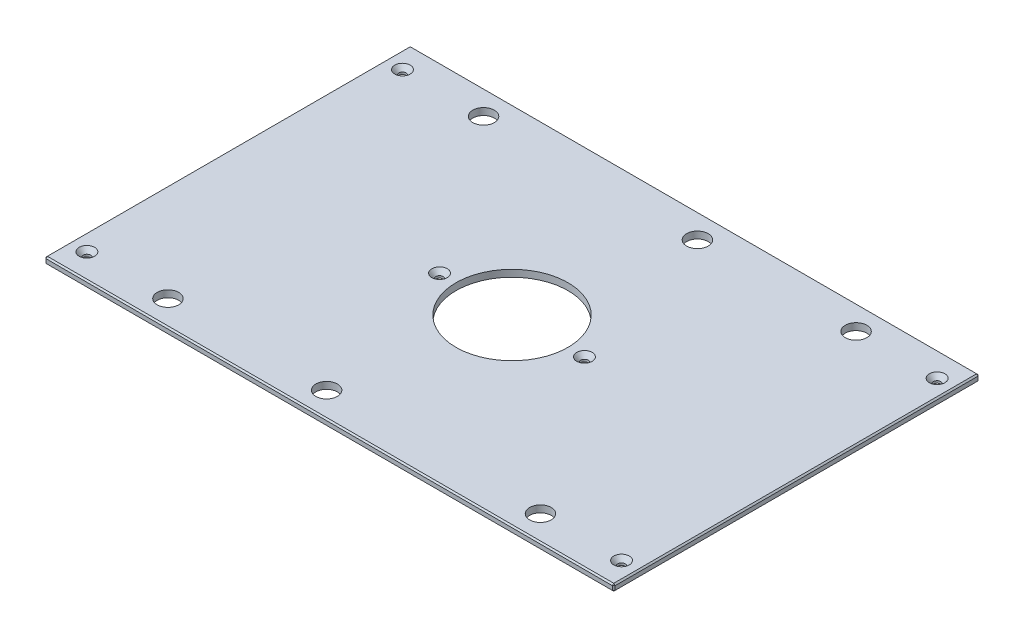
ISO-10303-21;
HEADER;
FILE_DESCRIPTION(('STEP AP214'),'2;1');
FILE_NAME('part.step','',(''),(''),'','','');
FILE_SCHEMA(('AUTOMOTIVE_DESIGN { 1 0 10303 214 1 1 1 1 }'));
ENDSEC;
DATA;
#1=APPLICATION_CONTEXT('core data for automotive mechanical design processes');
#2=APPLICATION_PROTOCOL_DEFINITION('international standard','automotive_design',2000,#1);
#3=PRODUCT_CONTEXT('',#1,'mechanical');
#4=PRODUCT('Part','Part','',(#3));
#5=PRODUCT_RELATED_PRODUCT_CATEGORY('part','',(#4));
#6=PRODUCT_DEFINITION_FORMATION('','',#4);
#7=PRODUCT_DEFINITION_CONTEXT('part definition',#1,'design');
#8=PRODUCT_DEFINITION('design','',#6,#7);
#9=PRODUCT_DEFINITION_SHAPE('','',#8);
#10=(LENGTH_UNIT() NAMED_UNIT(*) SI_UNIT(.MILLI.,.METRE.));
#11=(NAMED_UNIT(*) PLANE_ANGLE_UNIT() SI_UNIT($,.RADIAN.));
#12=(NAMED_UNIT(*) SI_UNIT($,.STERADIAN.) SOLID_ANGLE_UNIT());
#13=UNCERTAINTY_MEASURE_WITH_UNIT(LENGTH_MEASURE(1.E-05),#10,'distance_accuracy_value','');
#14=(GEOMETRIC_REPRESENTATION_CONTEXT(3) GLOBAL_UNCERTAINTY_ASSIGNED_CONTEXT((#13)) GLOBAL_UNIT_ASSIGNED_CONTEXT((#10,
#11,#12)) REPRESENTATION_CONTEXT('',''));
#15=CARTESIAN_POINT('',(0.,0.,0.));
#16=DIRECTION('',(0.,0.,1.));
#17=DIRECTION('',(1.,0.,0.));
#18=AXIS2_PLACEMENT_3D('',#15,#16,#17);
#19=CARTESIAN_POINT('',(-261.9375,6.35,-168.275));
#20=DIRECTION('',(1.,0.,0.));
#21=DIRECTION('',(0.,0.,-1.));
#22=AXIS2_PLACEMENT_3D('',#19,#20,#21);
#23=PLANE('',#22);
#24=DIRECTION('',(0.,0.,-1.));
#25=VECTOR('',#24,1.);
#26=CARTESIAN_POINT('',(-261.9375,5.08000000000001,-168.275));
#27=LINE('',#26,#25);
#28=CARTESIAN_POINT('',(-261.9375,5.08000000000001,167.005));
#29=VERTEX_POINT('',#28);
#30=CARTESIAN_POINT('',(-261.9375,5.08000000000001,-167.005));
#31=VERTEX_POINT('',#30);
#32=EDGE_CURVE('E135',#29,#31,#27,.T.);
#33=ORIENTED_EDGE('',*,*,#32,.T.);
#34=DIRECTION('',(0.,-1.,0.));
#35=VECTOR('',#34,1.);
#36=CARTESIAN_POINT('',(-261.9375,6.35,-167.005));
#37=LINE('',#36,#35);
#38=CARTESIAN_POINT('',(-261.9375,1.26999999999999,-167.005));
#39=VERTEX_POINT('',#38);
#40=EDGE_CURVE('E131',#31,#39,#37,.T.);
#41=ORIENTED_EDGE('',*,*,#40,.T.);
#42=DIRECTION('',(0.,0.,1.));
#43=VECTOR('',#42,1.);
#44=CARTESIAN_POINT('',(-261.9375,1.26999999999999,-168.275));
#45=LINE('',#44,#43);
#46=CARTESIAN_POINT('',(-261.9375,1.26999999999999,167.005));
#47=VERTEX_POINT('',#46);
#48=EDGE_CURVE('E126',#39,#47,#45,.T.);
#49=ORIENTED_EDGE('',*,*,#48,.T.);
#50=DIRECTION('',(0.,1.,0.));
#51=VECTOR('',#50,1.);
#52=CARTESIAN_POINT('',(-261.9375,6.35,167.005));
#53=LINE('',#52,#51);
#54=EDGE_CURVE('E128',#47,#29,#53,.T.);
#55=ORIENTED_EDGE('',*,*,#54,.T.);
#56=EDGE_LOOP('',(#33,#41,#49,#55));
#57=FACE_BOUND('',#56,.T.);
#58=ADVANCED_FACE('F35',(#57),#23,.F.);
#59=CARTESIAN_POINT('',(-261.9375,6.35,168.275));
#60=DIRECTION('',(0.,0.,-1.));
#61=DIRECTION('',(-1.,0.,0.));
#62=AXIS2_PLACEMENT_3D('',#59,#60,#61);
#63=PLANE('',#62);
#64=DIRECTION('',(1.,0.,0.));
#65=VECTOR('',#64,1.);
#66=CARTESIAN_POINT('',(-261.9375,1.26999999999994,168.275));
#67=LINE('',#66,#65);
#68=CARTESIAN_POINT('',(-260.6675,1.26999999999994,168.275));
#69=VERTEX_POINT('',#68);
#70=CARTESIAN_POINT('',(260.6675,1.26999999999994,168.275));
#71=VERTEX_POINT('',#70);
#72=EDGE_CURVE('E58',#69,#71,#67,.T.);
#73=ORIENTED_EDGE('',*,*,#72,.T.);
#74=DIRECTION('',(0.,1.,0.));
#75=VECTOR('',#74,1.);
#76=CARTESIAN_POINT('',(260.6675,6.35,168.275));
#77=LINE('',#76,#75);
#78=CARTESIAN_POINT('',(260.6675,5.08000000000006,168.275));
#79=VERTEX_POINT('',#78);
#80=EDGE_CURVE('E11',#71,#79,#77,.T.);
#81=ORIENTED_EDGE('',*,*,#80,.T.);
#82=DIRECTION('',(-1.,0.,0.));
#83=VECTOR('',#82,1.);
#84=CARTESIAN_POINT('',(-261.9375,5.08000000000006,168.275));
#85=LINE('',#84,#83);
#86=CARTESIAN_POINT('',(-260.6675,5.08000000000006,168.275));
#87=VERTEX_POINT('',#86);
#88=EDGE_CURVE('E44',#79,#87,#85,.T.);
#89=ORIENTED_EDGE('',*,*,#88,.T.);
#90=DIRECTION('',(0.,-1.,0.));
#91=VECTOR('',#90,1.);
#92=CARTESIAN_POINT('',(-260.6675,6.35,168.275));
#93=LINE('',#92,#91);
#94=EDGE_CURVE('E291',#87,#69,#93,.T.);
#95=ORIENTED_EDGE('',*,*,#94,.T.);
#96=EDGE_LOOP('',(#73,#81,#89,#95));
#97=FACE_BOUND('',#96,.T.);
#98=ADVANCED_FACE('F360',(#97),#63,.F.);
#99=CARTESIAN_POINT('',(261.9375,6.35,-168.275));
#100=DIRECTION('',(-1.,0.,0.));
#101=DIRECTION('',(0.,0.,1.));
#102=AXIS2_PLACEMENT_3D('',#99,#100,#101);
#103=PLANE('',#102);
#104=DIRECTION('',(0.,0.,-1.));
#105=VECTOR('',#104,1.);
#106=CARTESIAN_POINT('',(261.9375,1.26999999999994,-168.275));
#107=LINE('',#106,#105);
#108=CARTESIAN_POINT('',(261.9375,1.26999999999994,167.005));
#109=VERTEX_POINT('',#108);
#110=CARTESIAN_POINT('',(261.9375,1.26999999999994,-167.005));
#111=VERTEX_POINT('',#110);
#112=EDGE_CURVE('E286',#109,#111,#107,.T.);
#113=ORIENTED_EDGE('',*,*,#112,.T.);
#114=DIRECTION('',(0.,1.,0.));
#115=VECTOR('',#114,1.);
#116=CARTESIAN_POINT('',(261.9375,6.35,-167.005));
#117=LINE('',#116,#115);
#118=CARTESIAN_POINT('',(261.9375,5.08000000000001,-167.005));
#119=VERTEX_POINT('',#118);
#120=EDGE_CURVE('E288',#111,#119,#117,.T.);
#121=ORIENTED_EDGE('',*,*,#120,.T.);
#122=DIRECTION('',(0.,0.,1.));
#123=VECTOR('',#122,1.);
#124=CARTESIAN_POINT('',(261.9375,5.08000000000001,168.275));
#125=LINE('',#124,#123);
#126=CARTESIAN_POINT('',(261.9375,5.08000000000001,167.005));
#127=VERTEX_POINT('',#126);
#128=EDGE_CURVE('E284',#119,#127,#125,.T.);
#129=ORIENTED_EDGE('',*,*,#128,.T.);
#130=DIRECTION('',(0.,-1.,0.));
#131=VECTOR('',#130,1.);
#132=CARTESIAN_POINT('',(261.9375,6.35,167.005));
#133=LINE('',#132,#131);
#134=EDGE_CURVE('E282',#127,#109,#133,.T.);
#135=ORIENTED_EDGE('',*,*,#134,.T.);
#136=EDGE_LOOP('',(#113,#121,#129,#135));
#137=FACE_BOUND('',#136,.T.);
#138=ADVANCED_FACE('F347',(#137),#103,.F.);
#139=CARTESIAN_POINT('',(-261.9375,6.35,-168.275));
#140=DIRECTION('',(0.,0.,1.));
#141=DIRECTION('',(1.,0.,0.));
#142=AXIS2_PLACEMENT_3D('',#139,#140,#141);
#143=PLANE('',#142);
#144=DIRECTION('',(-1.,0.,0.));
#145=VECTOR('',#144,1.);
#146=CARTESIAN_POINT('',(-261.9375,1.26999999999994,-168.275));
#147=LINE('',#146,#145);
#148=CARTESIAN_POINT('',(260.6675,1.26999999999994,-168.275));
#149=VERTEX_POINT('',#148);
#150=CARTESIAN_POINT('',(-260.6675,1.26999999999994,-168.275));
#151=VERTEX_POINT('',#150);
#152=EDGE_CURVE('E258',#149,#151,#147,.T.);
#153=ORIENTED_EDGE('',*,*,#152,.T.);
#154=DIRECTION('',(0.,1.,0.));
#155=VECTOR('',#154,1.);
#156=CARTESIAN_POINT('',(-260.6675,6.35,-168.275));
#157=LINE('',#156,#155);
#158=CARTESIAN_POINT('',(-260.6675,5.08000000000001,-168.275));
#159=VERTEX_POINT('',#158);
#160=EDGE_CURVE('E262',#151,#159,#157,.T.);
#161=ORIENTED_EDGE('',*,*,#160,.T.);
#162=DIRECTION('',(1.,0.,0.));
#163=VECTOR('',#162,1.);
#164=CARTESIAN_POINT('',(261.9375,5.08000000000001,-168.275));
#165=LINE('',#164,#163);
#166=CARTESIAN_POINT('',(260.6675,5.08000000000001,-168.275));
#167=VERTEX_POINT('',#166);
#168=EDGE_CURVE('E260',#159,#167,#165,.T.);
#169=ORIENTED_EDGE('',*,*,#168,.T.);
#170=DIRECTION('',(0.,-1.,0.));
#171=VECTOR('',#170,1.);
#172=CARTESIAN_POINT('',(260.6675,6.35,-168.275));
#173=LINE('',#172,#171);
#174=EDGE_CURVE('E256',#167,#149,#173,.T.);
#175=ORIENTED_EDGE('',*,*,#174,.T.);
#176=EDGE_LOOP('',(#153,#161,#169,#175));
#177=FACE_BOUND('',#176,.T.);
#178=ADVANCED_FACE('F321',(#177),#143,.F.);
#179=CARTESIAN_POINT('',(0.,6.35,0.));
#180=DIRECTION('',(0.,1.,0.));
#181=DIRECTION('',(0.,0.,1.));
#182=AXIS2_PLACEMENT_3D('',#179,#180,#181);
#183=PLANE('',#182);
#184=CARTESIAN_POINT('',(246.0625,6.35,-145.25498));
#185=DIRECTION('',(0.,1.,0.));
#186=DIRECTION('',(0.,0.,1.));
#187=AXIS2_PLACEMENT_3D('',#184,#185,#186);
#188=CIRCLE('',#187,7.13739999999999);
#189=CARTESIAN_POINT('',(246.0625,6.35,-138.11758));
#190=VERTEX_POINT('',#189);
#191=EDGE_CURVE('E784',#190,#190,#188,.T.);
#192=ORIENTED_EDGE('',*,*,#191,.F.);
#193=EDGE_LOOP('',(#192));
#194=FACE_BOUND('',#193,.T.);
#195=CARTESIAN_POINT('',(246.0625,6.35,145.25498));
#196=DIRECTION('',(0.,1.,0.));
#197=DIRECTION('',(0.,0.,1.));
#198=AXIS2_PLACEMENT_3D('',#195,#196,#197);
#199=CIRCLE('',#198,7.13739999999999);
#200=CARTESIAN_POINT('',(246.0625,6.35,152.39238));
#201=VERTEX_POINT('',#200);
#202=EDGE_CURVE('E788',#201,#201,#199,.T.);
#203=ORIENTED_EDGE('',*,*,#202,.F.);
#204=EDGE_LOOP('',(#203));
#205=FACE_BOUND('',#204,.T.);
#206=CARTESIAN_POINT('',(-246.0625,6.35,145.25498));
#207=DIRECTION('',(0.,1.,0.));
#208=DIRECTION('',(0.,0.,1.));
#209=AXIS2_PLACEMENT_3D('',#206,#207,#208);
#210=CIRCLE('',#209,7.13739999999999);
#211=CARTESIAN_POINT('',(-246.0625,6.35,152.39238));
#212=VERTEX_POINT('',#211);
#213=EDGE_CURVE('E792',#212,#212,#210,.T.);
#214=ORIENTED_EDGE('',*,*,#213,.F.);
#215=EDGE_LOOP('',(#214));
#216=FACE_BOUND('',#215,.T.);
#217=CARTESIAN_POINT('',(-66.675,6.35,0.));
#218=DIRECTION('',(0.,1.,0.));
#219=DIRECTION('',(0.,0.,1.));
#220=AXIS2_PLACEMENT_3D('',#217,#218,#219);
#221=CIRCLE('',#220,7.1374);
#222=CARTESIAN_POINT('',(-66.675,6.35,7.1374));
#223=VERTEX_POINT('',#222);
#224=EDGE_CURVE('E796',#223,#223,#221,.T.);
#225=ORIENTED_EDGE('',*,*,#224,.F.);
#226=EDGE_LOOP('',(#225));
#227=FACE_BOUND('',#226,.T.);
#228=CARTESIAN_POINT('',(66.675,6.35,0.));
#229=DIRECTION('',(0.,1.,0.));
#230=DIRECTION('',(0.,0.,1.));
#231=AXIS2_PLACEMENT_3D('',#228,#229,#230);
#232=CIRCLE('',#231,7.1374);
#233=CARTESIAN_POINT('',(66.675,6.35,7.1374));
#234=VERTEX_POINT('',#233);
#235=EDGE_CURVE('E800',#234,#234,#232,.T.);
#236=ORIENTED_EDGE('',*,*,#235,.F.);
#237=EDGE_LOOP('',(#236));
#238=FACE_BOUND('',#237,.T.);
#239=CARTESIAN_POINT('',(-246.0625,6.35,-145.25498));
#240=DIRECTION('',(0.,1.,0.));
#241=DIRECTION('',(0.,0.,1.));
#242=AXIS2_PLACEMENT_3D('',#239,#240,#241);
#243=CIRCLE('',#242,7.13739999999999);
#244=CARTESIAN_POINT('',(-246.0625,6.35,-138.11758));
#245=VERTEX_POINT('',#244);
#246=EDGE_CURVE('E803',#245,#245,#243,.T.);
#247=ORIENTED_EDGE('',*,*,#246,.F.);
#248=EDGE_LOOP('',(#247));
#249=FACE_BOUND('',#248,.T.);
#250=DIRECTION('',(0.,0.,-1.));
#251=VECTOR('',#250,1.);
#252=CARTESIAN_POINT('',(260.6675,6.35,-168.275));
#253=LINE('',#252,#251);
#254=CARTESIAN_POINT('',(260.6675,6.35,167.005));
#255=VERTEX_POINT('',#254);
#256=CARTESIAN_POINT('',(260.6675,6.35,-167.005));
#257=VERTEX_POINT('',#256);
#258=EDGE_CURVE('E269',#255,#257,#253,.T.);
#259=ORIENTED_EDGE('',*,*,#258,.T.);
#260=DIRECTION('',(-1.,0.,0.));
#261=VECTOR('',#260,1.);
#262=CARTESIAN_POINT('',(-261.9375,6.35,-167.005));
#263=LINE('',#262,#261);
#264=CARTESIAN_POINT('',(-260.6675,6.35,-167.005));
#265=VERTEX_POINT('',#264);
#266=EDGE_CURVE('E271',#257,#265,#263,.T.);
#267=ORIENTED_EDGE('',*,*,#266,.T.);
#268=DIRECTION('',(0.,0.,1.));
#269=VECTOR('',#268,1.);
#270=CARTESIAN_POINT('',(-260.6675,6.35,168.275));
#271=LINE('',#270,#269);
#272=CARTESIAN_POINT('',(-260.6675,6.35,167.005));
#273=VERTEX_POINT('',#272);
#274=EDGE_CURVE('E267',#265,#273,#271,.T.);
#275=ORIENTED_EDGE('',*,*,#274,.T.);
#276=DIRECTION('',(1.,0.,0.));
#277=VECTOR('',#276,1.);
#278=CARTESIAN_POINT('',(261.9375,6.35,167.005));
#279=LINE('',#278,#277);
#280=EDGE_CURVE('E265',#273,#255,#279,.T.);
#281=ORIENTED_EDGE('',*,*,#280,.T.);
#282=EDGE_LOOP('',(#259,#267,#275,#281));
#283=FACE_BOUND('',#282,.T.);
#284=CARTESIAN_POINT('',(171.45,6.35,-145.25498));
#285=DIRECTION('',(0.,1.,0.));
#286=DIRECTION('',(0.,0.,1.));
#287=AXIS2_PLACEMENT_3D('',#284,#285,#286);
#288=CIRCLE('',#287,9.921875);
#289=CARTESIAN_POINT('',(171.45,6.35,-135.333105));
#290=VERTEX_POINT('',#289);
#291=EDGE_CURVE('E204',#290,#290,#288,.T.);
#292=ORIENTED_EDGE('',*,*,#291,.F.);
#293=EDGE_LOOP('',(#292));
#294=FACE_BOUND('',#293,.T.);
#295=CARTESIAN_POINT('',(-171.45,6.35,-145.25498));
#296=DIRECTION('',(0.,1.,0.));
#297=DIRECTION('',(0.,0.,1.));
#298=AXIS2_PLACEMENT_3D('',#295,#296,#297);
#299=CIRCLE('',#298,9.921875);
#300=CARTESIAN_POINT('',(-171.45,6.35,-135.333105));
#301=VERTEX_POINT('',#300);
#302=EDGE_CURVE('E214',#301,#301,#299,.T.);
#303=ORIENTED_EDGE('',*,*,#302,.F.);
#304=EDGE_LOOP('',(#303));
#305=FACE_BOUND('',#304,.T.);
#306=CARTESIAN_POINT('',(171.45,6.35,145.25498));
#307=DIRECTION('',(0.,1.,0.));
#308=DIRECTION('',(0.,0.,1.));
#309=AXIS2_PLACEMENT_3D('',#306,#307,#308);
#310=CIRCLE('',#309,9.921875);
#311=CARTESIAN_POINT('',(171.45,6.35,155.176855));
#312=VERTEX_POINT('',#311);
#313=EDGE_CURVE('E225',#312,#312,#310,.T.);
#314=ORIENTED_EDGE('',*,*,#313,.F.);
#315=EDGE_LOOP('',(#314));
#316=FACE_BOUND('',#315,.T.);
#317=CARTESIAN_POINT('',(-171.45,6.35,145.25498));
#318=DIRECTION('',(0.,1.,0.));
#319=DIRECTION('',(0.,0.,1.));
#320=AXIS2_PLACEMENT_3D('',#317,#318,#319);
#321=CIRCLE('',#320,9.921875);
#322=CARTESIAN_POINT('',(-171.45,6.35,155.176855));
#323=VERTEX_POINT('',#322);
#324=EDGE_CURVE('E231',#323,#323,#321,.T.);
#325=ORIENTED_EDGE('',*,*,#324,.F.);
#326=EDGE_LOOP('',(#325));
#327=FACE_BOUND('',#326,.T.);
#328=CARTESIAN_POINT('',(25.4,6.35,-145.25498));
#329=DIRECTION('',(0.,1.,0.));
#330=DIRECTION('',(0.,0.,1.));
#331=AXIS2_PLACEMENT_3D('',#328,#329,#330);
#332=CIRCLE('',#331,9.921875);
#333=CARTESIAN_POINT('',(25.4,6.35,-135.333105));
#334=VERTEX_POINT('',#333);
#335=EDGE_CURVE('E237',#334,#334,#332,.T.);
#336=ORIENTED_EDGE('',*,*,#335,.F.);
#337=EDGE_LOOP('',(#336));
#338=FACE_BOUND('',#337,.T.);
#339=CARTESIAN_POINT('',(-25.4,6.35,145.25498));
#340=DIRECTION('',(0.,1.,0.));
#341=DIRECTION('',(0.,0.,1.));
#342=AXIS2_PLACEMENT_3D('',#339,#340,#341);
#343=CIRCLE('',#342,9.921875);
#344=CARTESIAN_POINT('',(-25.4,6.35,155.176855));
#345=VERTEX_POINT('',#344);
#346=EDGE_CURVE('E243',#345,#345,#343,.T.);
#347=ORIENTED_EDGE('',*,*,#346,.F.);
#348=EDGE_LOOP('',(#347));
#349=FACE_BOUND('',#348,.T.);
#350=CARTESIAN_POINT('',(0.,6.35,0.));
#351=DIRECTION('',(0.,1.,0.));
#352=DIRECTION('',(0.,0.,1.));
#353=AXIS2_PLACEMENT_3D('',#350,#351,#352);
#354=CIRCLE('',#353,51.562);
#355=CARTESIAN_POINT('',(0.,6.35,51.562));
#356=VERTEX_POINT('',#355);
#357=EDGE_CURVE('E249',#356,#356,#354,.T.);
#358=ORIENTED_EDGE('',*,*,#357,.F.);
#359=EDGE_LOOP('',(#358));
#360=FACE_BOUND('',#359,.T.);
#361=ADVANCED_FACE('F369',(#194,#205,#216,#227,#238,#249,#283,#294,#305,#316,#327,#338,#349,
#360),#183,.T.);
#362=CARTESIAN_POINT('',(0.,0.,0.));
#363=DIRECTION('',(0.,1.,0.));
#364=DIRECTION('',(0.,0.,1.));
#365=AXIS2_PLACEMENT_3D('',#362,#363,#364);
#366=PLANE('',#365);
#367=CARTESIAN_POINT('',(246.0625,0.,-145.25498));
#368=DIRECTION('',(0.,1.,0.));
#369=DIRECTION('',(0.,0.,1.));
#370=AXIS2_PLACEMENT_3D('',#367,#368,#369);
#371=CIRCLE('',#370,3.3782);
#372=CARTESIAN_POINT('',(246.0625,0.,-141.87678));
#373=VERTEX_POINT('',#372);
#374=EDGE_CURVE('E837',#373,#373,#371,.T.);
#375=ORIENTED_EDGE('',*,*,#374,.T.);
#376=EDGE_LOOP('',(#375));
#377=FACE_BOUND('',#376,.T.);
#378=CARTESIAN_POINT('',(246.0625,0.,145.25498));
#379=DIRECTION('',(0.,1.,0.));
#380=DIRECTION('',(0.,0.,1.));
#381=AXIS2_PLACEMENT_3D('',#378,#379,#380);
#382=CIRCLE('',#381,3.3782);
#383=CARTESIAN_POINT('',(246.0625,0.,148.63318));
#384=VERTEX_POINT('',#383);
#385=EDGE_CURVE('E830',#384,#384,#382,.T.);
#386=ORIENTED_EDGE('',*,*,#385,.T.);
#387=EDGE_LOOP('',(#386));
#388=FACE_BOUND('',#387,.T.);
#389=CARTESIAN_POINT('',(-246.0625,0.,145.25498));
#390=DIRECTION('',(0.,1.,0.));
#391=DIRECTION('',(0.,0.,1.));
#392=AXIS2_PLACEMENT_3D('',#389,#390,#391);
#393=CIRCLE('',#392,3.3782);
#394=CARTESIAN_POINT('',(-246.0625,0.,148.63318));
#395=VERTEX_POINT('',#394);
#396=EDGE_CURVE('E823',#395,#395,#393,.T.);
#397=ORIENTED_EDGE('',*,*,#396,.T.);
#398=EDGE_LOOP('',(#397));
#399=FACE_BOUND('',#398,.T.);
#400=CARTESIAN_POINT('',(-66.675,0.,0.));
#401=DIRECTION('',(0.,1.,0.));
#402=DIRECTION('',(0.,0.,1.));
#403=AXIS2_PLACEMENT_3D('',#400,#401,#402);
#404=CIRCLE('',#403,3.3782);
#405=CARTESIAN_POINT('',(-66.675,0.,3.3782));
#406=VERTEX_POINT('',#405);
#407=EDGE_CURVE('E816',#406,#406,#404,.T.);
#408=ORIENTED_EDGE('',*,*,#407,.T.);
#409=EDGE_LOOP('',(#408));
#410=FACE_BOUND('',#409,.T.);
#411=CARTESIAN_POINT('',(66.675,0.,0.));
#412=DIRECTION('',(0.,1.,0.));
#413=DIRECTION('',(0.,0.,1.));
#414=AXIS2_PLACEMENT_3D('',#411,#412,#413);
#415=CIRCLE('',#414,3.3782);
#416=CARTESIAN_POINT('',(66.675,0.,3.3782));
#417=VERTEX_POINT('',#416);
#418=EDGE_CURVE('E806',#417,#417,#415,.T.);
#419=ORIENTED_EDGE('',*,*,#418,.T.);
#420=EDGE_LOOP('',(#419));
#421=FACE_BOUND('',#420,.T.);
#422=CARTESIAN_POINT('',(-246.0625,0.,-145.25498));
#423=DIRECTION('',(0.,1.,0.));
#424=DIRECTION('',(0.,0.,1.));
#425=AXIS2_PLACEMENT_3D('',#422,#423,#424);
#426=CIRCLE('',#425,3.3782);
#427=CARTESIAN_POINT('',(-246.0625,0.,-141.87678));
#428=VERTEX_POINT('',#427);
#429=EDGE_CURVE('E217',#428,#428,#426,.T.);
#430=ORIENTED_EDGE('',*,*,#429,.T.);
#431=EDGE_LOOP('',(#430));
#432=FACE_BOUND('',#431,.T.);
#433=DIRECTION('',(0.,0.,-1.));
#434=VECTOR('',#433,1.);
#435=CARTESIAN_POINT('',(-260.6675,0.,0.));
#436=LINE('',#435,#434);
#437=CARTESIAN_POINT('',(-260.6675,0.,167.005));
#438=VERTEX_POINT('',#437);
#439=CARTESIAN_POINT('',(-260.6675,0.,-167.005));
#440=VERTEX_POINT('',#439);
#441=EDGE_CURVE('E158',#438,#440,#436,.T.);
#442=ORIENTED_EDGE('',*,*,#441,.T.);
#443=DIRECTION('',(1.,0.,0.));
#444=VECTOR('',#443,1.);
#445=CARTESIAN_POINT('',(0.,0.,-167.005));
#446=LINE('',#445,#444);
#447=CARTESIAN_POINT('',(260.6675,0.,-167.005));
#448=VERTEX_POINT('',#447);
#449=EDGE_CURVE('E279',#440,#448,#446,.T.);
#450=ORIENTED_EDGE('',*,*,#449,.T.);
#451=DIRECTION('',(0.,0.,1.));
#452=VECTOR('',#451,1.);
#453=CARTESIAN_POINT('',(260.6675,0.,0.));
#454=LINE('',#453,#452);
#455=CARTESIAN_POINT('',(260.6675,0.,167.005));
#456=VERTEX_POINT('',#455);
#457=EDGE_CURVE('E277',#448,#456,#454,.T.);
#458=ORIENTED_EDGE('',*,*,#457,.T.);
#459=DIRECTION('',(-1.,0.,0.));
#460=VECTOR('',#459,1.);
#461=CARTESIAN_POINT('',(0.,0.,167.005));
#462=LINE('',#461,#460);
#463=EDGE_CURVE('E274',#456,#438,#462,.T.);
#464=ORIENTED_EDGE('',*,*,#463,.T.);
#465=EDGE_LOOP('',(#442,#450,#458,#464));
#466=FACE_BOUND('',#465,.T.);
#467=CARTESIAN_POINT('',(171.45,0.,-145.25498));
#468=DIRECTION('',(0.,1.,0.));
#469=DIRECTION('',(0.,0.,1.));
#470=AXIS2_PLACEMENT_3D('',#467,#468,#469);
#471=CIRCLE('',#470,9.921875);
#472=CARTESIAN_POINT('',(171.45,0.,-135.333105));
#473=VERTEX_POINT('',#472);
#474=EDGE_CURVE('E209',#473,#473,#471,.T.);
#475=ORIENTED_EDGE('',*,*,#474,.T.);
#476=EDGE_LOOP('',(#475));
#477=FACE_BOUND('',#476,.T.);
#478=CARTESIAN_POINT('',(-171.45,0.,-145.25498));
#479=DIRECTION('',(0.,1.,0.));
#480=DIRECTION('',(0.,0.,1.));
#481=AXIS2_PLACEMENT_3D('',#478,#479,#480);
#482=CIRCLE('',#481,9.921875);
#483=CARTESIAN_POINT('',(-171.45,0.,-135.333105));
#484=VERTEX_POINT('',#483);
#485=EDGE_CURVE('E222',#484,#484,#482,.T.);
#486=ORIENTED_EDGE('',*,*,#485,.T.);
#487=EDGE_LOOP('',(#486));
#488=FACE_BOUND('',#487,.T.);
#489=CARTESIAN_POINT('',(171.45,0.,145.25498));
#490=DIRECTION('',(0.,1.,0.));
#491=DIRECTION('',(0.,0.,1.));
#492=AXIS2_PLACEMENT_3D('',#489,#490,#491);
#493=CIRCLE('',#492,9.921875);
#494=CARTESIAN_POINT('',(171.45,0.,155.176855));
#495=VERTEX_POINT('',#494);
#496=EDGE_CURVE('E228',#495,#495,#493,.T.);
#497=ORIENTED_EDGE('',*,*,#496,.T.);
#498=EDGE_LOOP('',(#497));
#499=FACE_BOUND('',#498,.T.);
#500=CARTESIAN_POINT('',(-171.45,0.,145.25498));
#501=DIRECTION('',(0.,1.,0.));
#502=DIRECTION('',(0.,0.,1.));
#503=AXIS2_PLACEMENT_3D('',#500,#501,#502);
#504=CIRCLE('',#503,9.921875);
#505=CARTESIAN_POINT('',(-171.45,0.,155.176855));
#506=VERTEX_POINT('',#505);
#507=EDGE_CURVE('E234',#506,#506,#504,.T.);
#508=ORIENTED_EDGE('',*,*,#507,.T.);
#509=EDGE_LOOP('',(#508));
#510=FACE_BOUND('',#509,.T.);
#511=CARTESIAN_POINT('',(25.4,0.,-145.25498));
#512=DIRECTION('',(0.,1.,0.));
#513=DIRECTION('',(0.,0.,1.));
#514=AXIS2_PLACEMENT_3D('',#511,#512,#513);
#515=CIRCLE('',#514,9.921875);
#516=CARTESIAN_POINT('',(25.4,0.,-135.333105));
#517=VERTEX_POINT('',#516);
#518=EDGE_CURVE('E240',#517,#517,#515,.T.);
#519=ORIENTED_EDGE('',*,*,#518,.T.);
#520=EDGE_LOOP('',(#519));
#521=FACE_BOUND('',#520,.T.);
#522=CARTESIAN_POINT('',(-25.4,0.,145.25498));
#523=DIRECTION('',(0.,1.,0.));
#524=DIRECTION('',(0.,0.,1.));
#525=AXIS2_PLACEMENT_3D('',#522,#523,#524);
#526=CIRCLE('',#525,9.921875);
#527=CARTESIAN_POINT('',(-25.4,0.,155.176855));
#528=VERTEX_POINT('',#527);
#529=EDGE_CURVE('E246',#528,#528,#526,.T.);
#530=ORIENTED_EDGE('',*,*,#529,.T.);
#531=EDGE_LOOP('',(#530));
#532=FACE_BOUND('',#531,.T.);
#533=CARTESIAN_POINT('',(0.,0.,0.));
#534=DIRECTION('',(0.,1.,0.));
#535=DIRECTION('',(0.,0.,1.));
#536=AXIS2_PLACEMENT_3D('',#533,#534,#535);
#537=CIRCLE('',#536,51.562);
#538=CARTESIAN_POINT('',(0.,0.,51.562));
#539=VERTEX_POINT('',#538);
#540=EDGE_CURVE('E147',#539,#539,#537,.T.);
#541=ORIENTED_EDGE('',*,*,#540,.T.);
#542=EDGE_LOOP('',(#541));
#543=FACE_BOUND('',#542,.T.);
#544=ADVANCED_FACE('F334',(#377,#388,#399,#410,#421,#432,#466,#477,#488,#499,#510,#521,#532,
#543),#366,.F.);
#545=CARTESIAN_POINT('',(0.,0.,0.));
#546=DIRECTION('',(0.,1.,0.));
#547=DIRECTION('',(0.,0.,1.));
#548=AXIS2_PLACEMENT_3D('',#545,#546,#547);
#549=CYLINDRICAL_SURFACE('',#548,51.562);
#550=ORIENTED_EDGE('',*,*,#540,.F.);
#551=EDGE_LOOP('',(#550));
#552=FACE_BOUND('',#551,.T.);
#553=ORIENTED_EDGE('',*,*,#357,.T.);
#554=EDGE_LOOP('',(#553));
#555=FACE_BOUND('',#554,.T.);
#556=ADVANCED_FACE('F721',(#552,#555),#549,.F.);
#557=CARTESIAN_POINT('',(-25.4,6.35,145.25498));
#558=DIRECTION('',(0.,1.,0.));
#559=DIRECTION('',(0.,0.,1.));
#560=AXIS2_PLACEMENT_3D('',#557,#558,#559);
#561=CYLINDRICAL_SURFACE('',#560,9.921875);
#562=ORIENTED_EDGE('',*,*,#529,.F.);
#563=EDGE_LOOP('',(#562));
#564=FACE_BOUND('',#563,.T.);
#565=ORIENTED_EDGE('',*,*,#346,.T.);
#566=EDGE_LOOP('',(#565));
#567=FACE_BOUND('',#566,.T.);
#568=ADVANCED_FACE('F712',(#564,#567),#561,.F.);
#569=CARTESIAN_POINT('',(25.4,6.35,-145.25498));
#570=DIRECTION('',(0.,1.,0.));
#571=DIRECTION('',(0.,0.,1.));
#572=AXIS2_PLACEMENT_3D('',#569,#570,#571);
#573=CYLINDRICAL_SURFACE('',#572,9.921875);
#574=ORIENTED_EDGE('',*,*,#518,.F.);
#575=EDGE_LOOP('',(#574));
#576=FACE_BOUND('',#575,.T.);
#577=ORIENTED_EDGE('',*,*,#335,.T.);
#578=EDGE_LOOP('',(#577));
#579=FACE_BOUND('',#578,.T.);
#580=ADVANCED_FACE('F703',(#576,#579),#573,.F.);
#581=CARTESIAN_POINT('',(-171.45,6.35,145.25498));
#582=DIRECTION('',(0.,1.,0.));
#583=DIRECTION('',(0.,0.,1.));
#584=AXIS2_PLACEMENT_3D('',#581,#582,#583);
#585=CYLINDRICAL_SURFACE('',#584,9.921875);
#586=ORIENTED_EDGE('',*,*,#507,.F.);
#587=EDGE_LOOP('',(#586));
#588=FACE_BOUND('',#587,.T.);
#589=ORIENTED_EDGE('',*,*,#324,.T.);
#590=EDGE_LOOP('',(#589));
#591=FACE_BOUND('',#590,.T.);
#592=ADVANCED_FACE('F694',(#588,#591),#585,.F.);
#593=CARTESIAN_POINT('',(171.45,6.35,145.25498));
#594=DIRECTION('',(0.,1.,0.));
#595=DIRECTION('',(0.,0.,1.));
#596=AXIS2_PLACEMENT_3D('',#593,#594,#595);
#597=CYLINDRICAL_SURFACE('',#596,9.921875);
#598=ORIENTED_EDGE('',*,*,#496,.F.);
#599=EDGE_LOOP('',(#598));
#600=FACE_BOUND('',#599,.T.);
#601=ORIENTED_EDGE('',*,*,#313,.T.);
#602=EDGE_LOOP('',(#601));
#603=FACE_BOUND('',#602,.T.);
#604=ADVANCED_FACE('F685',(#600,#603),#597,.F.);
#605=CARTESIAN_POINT('',(-171.45,6.35,-145.25498));
#606=DIRECTION('',(0.,1.,0.));
#607=DIRECTION('',(0.,0.,1.));
#608=AXIS2_PLACEMENT_3D('',#605,#606,#607);
#609=CYLINDRICAL_SURFACE('',#608,9.921875);
#610=ORIENTED_EDGE('',*,*,#485,.F.);
#611=EDGE_LOOP('',(#610));
#612=FACE_BOUND('',#611,.T.);
#613=ORIENTED_EDGE('',*,*,#302,.T.);
#614=EDGE_LOOP('',(#613));
#615=FACE_BOUND('',#614,.T.);
#616=ADVANCED_FACE('F675',(#612,#615),#609,.F.);
#617=CARTESIAN_POINT('',(171.45,6.35,-145.25498));
#618=DIRECTION('',(0.,1.,0.));
#619=DIRECTION('',(0.,0.,1.));
#620=AXIS2_PLACEMENT_3D('',#617,#618,#619);
#621=CYLINDRICAL_SURFACE('',#620,9.921875);
#622=ORIENTED_EDGE('',*,*,#474,.F.);
#623=EDGE_LOOP('',(#622));
#624=FACE_BOUND('',#623,.T.);
#625=ORIENTED_EDGE('',*,*,#291,.T.);
#626=EDGE_LOOP('',(#625));
#627=FACE_BOUND('',#626,.T.);
#628=ADVANCED_FACE('F378',(#624,#627),#621,.F.);
#629=CARTESIAN_POINT('',(261.9375,6.35,167.005));
#630=DIRECTION('',(-0.707106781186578,0.,-0.707106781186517));
#631=DIRECTION('',(0.,-1.,0.));
#632=AXIS2_PLACEMENT_3D('',#629,#630,#631);
#633=PLANE('',#632);
#634=DIRECTION('',(-0.707106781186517,0.,0.707106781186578));
#635=VECTOR('',#634,1.);
#636=CARTESIAN_POINT('',(261.9375,5.08000000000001,167.005));
#637=LINE('',#636,#635);
#638=EDGE_CURVE('E39',#79,#127,#637,.F.);
#639=ORIENTED_EDGE('',*,*,#638,.F.);
#640=ORIENTED_EDGE('',*,*,#80,.F.);
#641=DIRECTION('',(0.707106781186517,0.,-0.707106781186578));
#642=VECTOR('',#641,1.);
#643=CARTESIAN_POINT('',(261.3025,1.26999999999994,167.64));
#644=LINE('',#643,#642);
#645=EDGE_CURVE('E197',#109,#71,#644,.F.);
#646=ORIENTED_EDGE('',*,*,#645,.F.);
#647=ORIENTED_EDGE('',*,*,#134,.F.);
#648=EDGE_LOOP('',(#639,#640,#646,#647));
#649=FACE_BOUND('',#648,.T.);
#650=ADVANCED_FACE('F37',(#649),#633,.F.);
#651=CARTESIAN_POINT('',(261.9375,5.08000000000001,167.005));
#652=DIRECTION('',(0.577350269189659,0.577350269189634,0.577350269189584));
#653=DIRECTION('',(-0.707106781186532,0.707106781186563,0.));
#654=AXIS2_PLACEMENT_3D('',#651,#652,#653);
#655=PLANE('',#654);
#656=DIRECTION('',(0.,-0.707106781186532,0.707106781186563));
#657=VECTOR('',#656,1.);
#658=CARTESIAN_POINT('',(260.6675,5.715,167.64));
#659=LINE('',#658,#657);
#660=EDGE_CURVE('E193',#79,#255,#659,.F.);
#661=ORIENTED_EDGE('',*,*,#660,.F.);
#662=ORIENTED_EDGE('',*,*,#638,.T.);
#663=DIRECTION('',(-0.707106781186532,0.707106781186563,0.));
#664=VECTOR('',#663,1.);
#665=CARTESIAN_POINT('',(261.9375,5.08000000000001,167.005));
#666=LINE('',#665,#664);
#667=EDGE_CURVE('E195',#255,#127,#666,.F.);
#668=ORIENTED_EDGE('',*,*,#667,.F.);
#669=EDGE_LOOP('',(#661,#662,#668));
#670=FACE_BOUND('',#669,.T.);
#671=ADVANCED_FACE('F371',(#670),#655,.T.);
#672=CARTESIAN_POINT('',(260.6675,0.,167.005));
#673=DIRECTION('',(0.577350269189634,-0.577350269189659,0.577350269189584));
#674=DIRECTION('',(0.707106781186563,0.707106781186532,0.));
#675=AXIS2_PLACEMENT_3D('',#672,#673,#674);
#676=PLANE('',#675);
#677=DIRECTION('',(-0.707106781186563,-0.707106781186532,0.));
#678=VECTOR('',#677,1.);
#679=CARTESIAN_POINT('',(260.6675,0.,167.005));
#680=LINE('',#679,#678);
#681=EDGE_CURVE('E187',#109,#456,#680,.T.);
#682=ORIENTED_EDGE('',*,*,#681,.F.);
#683=ORIENTED_EDGE('',*,*,#645,.T.);
#684=DIRECTION('',(0.,0.707106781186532,0.707106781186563));
#685=VECTOR('',#684,1.);
#686=CARTESIAN_POINT('',(260.6675,0.,167.005));
#687=LINE('',#686,#685);
#688=EDGE_CURVE('E190',#456,#71,#687,.T.);
#689=ORIENTED_EDGE('',*,*,#688,.F.);
#690=EDGE_LOOP('',(#682,#683,#689));
#691=FACE_BOUND('',#690,.T.);
#692=ADVANCED_FACE('F340',(#691),#676,.T.);
#693=CARTESIAN_POINT('',(260.6675,6.35,0.));
#694=DIRECTION('',(0.707106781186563,0.707106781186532,0.));
#695=DIRECTION('',(0.,0.,1.));
#696=AXIS2_PLACEMENT_3D('',#693,#694,#695);
#697=PLANE('',#696);
#698=ORIENTED_EDGE('',*,*,#667,.T.);
#699=ORIENTED_EDGE('',*,*,#128,.F.);
#700=DIRECTION('',(0.707106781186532,-0.707106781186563,0.));
#701=VECTOR('',#700,1.);
#702=CARTESIAN_POINT('',(261.3025,5.71499999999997,-167.005));
#703=LINE('',#702,#701);
#704=EDGE_CURVE('E182',#257,#119,#703,.T.);
#705=ORIENTED_EDGE('',*,*,#704,.F.);
#706=ORIENTED_EDGE('',*,*,#258,.F.);
#707=EDGE_LOOP('',(#698,#699,#705,#706));
#708=FACE_BOUND('',#707,.T.);
#709=ADVANCED_FACE('F357',(#708),#697,.T.);
#710=CARTESIAN_POINT('',(0.,6.35,167.005));
#711=DIRECTION('',(0.,0.707106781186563,0.707106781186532));
#712=DIRECTION('',(-1.,0.,0.));
#713=AXIS2_PLACEMENT_3D('',#710,#711,#712);
#714=PLANE('',#713);
#715=ORIENTED_EDGE('',*,*,#660,.T.);
#716=ORIENTED_EDGE('',*,*,#280,.F.);
#717=DIRECTION('',(0.,0.707106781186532,-0.707106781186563));
#718=VECTOR('',#717,1.);
#719=CARTESIAN_POINT('',(-260.6675,6.35,167.005));
#720=LINE('',#719,#718);
#721=EDGE_CURVE('E179',#87,#273,#720,.T.);
#722=ORIENTED_EDGE('',*,*,#721,.F.);
#723=ORIENTED_EDGE('',*,*,#88,.F.);
#724=EDGE_LOOP('',(#715,#716,#722,#723));
#725=FACE_BOUND('',#724,.T.);
#726=ADVANCED_FACE('F362',(#725),#714,.T.);
#727=CARTESIAN_POINT('',(-260.6675,6.35,168.275));
#728=DIRECTION('',(0.707106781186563,0.,-0.707106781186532));
#729=DIRECTION('',(0.,-1.,0.));
#730=AXIS2_PLACEMENT_3D('',#727,#728,#729);
#731=PLANE('',#730);
#732=DIRECTION('',(0.707106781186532,0.,0.707106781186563));
#733=VECTOR('',#732,1.);
#734=CARTESIAN_POINT('',(-261.9375,1.26999999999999,167.005));
#735=LINE('',#734,#733);
#736=EDGE_CURVE('E142',#69,#47,#735,.F.);
#737=ORIENTED_EDGE('',*,*,#736,.F.);
#738=ORIENTED_EDGE('',*,*,#94,.F.);
#739=DIRECTION('',(-0.707106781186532,0.,-0.707106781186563));
#740=VECTOR('',#739,1.);
#741=CARTESIAN_POINT('',(-261.3025,5.08000000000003,167.64));
#742=LINE('',#741,#740);
#743=EDGE_CURVE('E145',#29,#87,#742,.F.);
#744=ORIENTED_EDGE('',*,*,#743,.F.);
#745=ORIENTED_EDGE('',*,*,#54,.F.);
#746=EDGE_LOOP('',(#737,#738,#744,#745));
#747=FACE_BOUND('',#746,.T.);
#748=ADVANCED_FACE('F140',(#747),#731,.F.);
#749=CARTESIAN_POINT('',(-261.9375,1.26999999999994,168.275));
#750=DIRECTION('',(0.,0.707106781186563,-0.707106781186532));
#751=DIRECTION('',(1.,0.,0.));
#752=AXIS2_PLACEMENT_3D('',#749,#750,#751);
#753=PLANE('',#752);
#754=ORIENTED_EDGE('',*,*,#688,.T.);
#755=ORIENTED_EDGE('',*,*,#72,.F.);
#756=DIRECTION('',(0.,-0.707106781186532,-0.707106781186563));
#757=VECTOR('',#756,1.);
#758=CARTESIAN_POINT('',(-260.6675,0.634999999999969,167.64));
#759=LINE('',#758,#757);
#760=EDGE_CURVE('E155',#438,#69,#759,.F.);
#761=ORIENTED_EDGE('',*,*,#760,.F.);
#762=ORIENTED_EDGE('',*,*,#463,.F.);
#763=EDGE_LOOP('',(#754,#755,#761,#762));
#764=FACE_BOUND('',#763,.T.);
#765=ADVANCED_FACE('F339',(#764),#753,.F.);
#766=CARTESIAN_POINT('',(261.9375,1.26999999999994,-168.275));
#767=DIRECTION('',(-0.707106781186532,0.707106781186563,0.));
#768=DIRECTION('',(0.,0.,-1.));
#769=AXIS2_PLACEMENT_3D('',#766,#767,#768);
#770=PLANE('',#769);
#771=ORIENTED_EDGE('',*,*,#681,.T.);
#772=ORIENTED_EDGE('',*,*,#457,.F.);
#773=DIRECTION('',(0.707106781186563,0.707106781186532,0.));
#774=VECTOR('',#773,1.);
#775=CARTESIAN_POINT('',(260.6675,0.,-167.005));
#776=LINE('',#775,#774);
#777=EDGE_CURVE('E174',#111,#448,#776,.F.);
#778=ORIENTED_EDGE('',*,*,#777,.F.);
#779=ORIENTED_EDGE('',*,*,#112,.F.);
#780=EDGE_LOOP('',(#771,#772,#778,#779));
#781=FACE_BOUND('',#780,.T.);
#782=ADVANCED_FACE('F344',(#781),#770,.F.);
#783=CARTESIAN_POINT('',(260.6675,6.35,-168.275));
#784=DIRECTION('',(-0.707106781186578,0.,0.707106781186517));
#785=DIRECTION('',(0.,-1.,0.));
#786=AXIS2_PLACEMENT_3D('',#783,#784,#785);
#787=PLANE('',#786);
#788=DIRECTION('',(0.707106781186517,0.,0.707106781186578));
#789=VECTOR('',#788,1.);
#790=CARTESIAN_POINT('',(260.6675,5.08000000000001,-168.275));
#791=LINE('',#790,#789);
#792=EDGE_CURVE('E184',#119,#167,#791,.F.);
#793=ORIENTED_EDGE('',*,*,#792,.F.);
#794=ORIENTED_EDGE('',*,*,#120,.F.);
#795=DIRECTION('',(-0.707106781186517,0.,-0.707106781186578));
#796=VECTOR('',#795,1.);
#797=CARTESIAN_POINT('',(261.3025,1.26999999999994,-167.64));
#798=LINE('',#797,#796);
#799=EDGE_CURVE('E171',#149,#111,#798,.F.);
#800=ORIENTED_EDGE('',*,*,#799,.F.);
#801=ORIENTED_EDGE('',*,*,#174,.F.);
#802=EDGE_LOOP('',(#793,#794,#800,#801));
#803=FACE_BOUND('',#802,.T.);
#804=ADVANCED_FACE('F352',(#803),#787,.F.);
#805=CARTESIAN_POINT('',(260.6675,5.08000000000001,-168.275));
#806=DIRECTION('',(0.577350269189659,0.577350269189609,-0.577350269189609));
#807=DIRECTION('',(-0.707106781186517,0.,-0.707106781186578));
#808=AXIS2_PLACEMENT_3D('',#805,#806,#807);
#809=PLANE('',#808);
#810=ORIENTED_EDGE('',*,*,#704,.T.);
#811=ORIENTED_EDGE('',*,*,#792,.T.);
#812=DIRECTION('',(0.,0.707106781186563,0.707106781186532));
#813=VECTOR('',#812,1.);
#814=CARTESIAN_POINT('',(260.6675,5.08000000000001,-168.275));
#815=LINE('',#814,#813);
#816=EDGE_CURVE('E163',#257,#167,#815,.F.);
#817=ORIENTED_EDGE('',*,*,#816,.F.);
#818=EDGE_LOOP('',(#810,#811,#817));
#819=FACE_BOUND('',#818,.T.);
#820=ADVANCED_FACE('F410',(#819),#809,.T.);
#821=CARTESIAN_POINT('',(-260.6675,6.35,167.005));
#822=DIRECTION('',(-0.577350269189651,0.577350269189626,0.577350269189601));
#823=DIRECTION('',(-0.707106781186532,-0.707106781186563,0.));
#824=AXIS2_PLACEMENT_3D('',#821,#822,#823);
#825=PLANE('',#824);
#826=ORIENTED_EDGE('',*,*,#743,.T.);
#827=ORIENTED_EDGE('',*,*,#721,.T.);
#828=DIRECTION('',(-0.707106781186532,-0.707106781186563,0.));
#829=VECTOR('',#828,1.);
#830=CARTESIAN_POINT('',(-260.6675,6.35,167.005));
#831=LINE('',#830,#829);
#832=EDGE_CURVE('E159',#29,#273,#831,.F.);
#833=ORIENTED_EDGE('',*,*,#832,.F.);
#834=EDGE_LOOP('',(#826,#827,#833));
#835=FACE_BOUND('',#834,.T.);
#836=ADVANCED_FACE('F364',(#835),#825,.T.);
#837=CARTESIAN_POINT('',(-261.9375,1.26999999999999,167.005));
#838=DIRECTION('',(-0.577350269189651,-0.577350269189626,0.577350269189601));
#839=DIRECTION('',(0.707106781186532,-0.707106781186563,0.));
#840=AXIS2_PLACEMENT_3D('',#837,#838,#839);
#841=PLANE('',#840);
#842=ORIENTED_EDGE('',*,*,#760,.T.);
#843=ORIENTED_EDGE('',*,*,#736,.T.);
#844=DIRECTION('',(-0.707106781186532,0.707106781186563,0.));
#845=VECTOR('',#844,1.);
#846=CARTESIAN_POINT('',(-261.9375,1.26999999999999,167.005));
#847=LINE('',#846,#845);
#848=EDGE_CURVE('E152',#438,#47,#847,.T.);
#849=ORIENTED_EDGE('',*,*,#848,.F.);
#850=EDGE_LOOP('',(#842,#843,#849));
#851=FACE_BOUND('',#850,.T.);
#852=ADVANCED_FACE('F151',(#851),#841,.T.);
#853=CARTESIAN_POINT('',(260.6675,0.,-167.005));
#854=DIRECTION('',(0.577350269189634,-0.577350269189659,-0.577350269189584));
#855=DIRECTION('',(0.707106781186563,0.707106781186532,0.));
#856=AXIS2_PLACEMENT_3D('',#853,#854,#855);
#857=PLANE('',#856);
#858=ORIENTED_EDGE('',*,*,#799,.T.);
#859=ORIENTED_EDGE('',*,*,#777,.T.);
#860=DIRECTION('',(0.,-0.707106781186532,0.707106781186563));
#861=VECTOR('',#860,1.);
#862=CARTESIAN_POINT('',(260.6675,0.,-167.005));
#863=LINE('',#862,#861);
#864=EDGE_CURVE('E160',#149,#448,#863,.T.);
#865=ORIENTED_EDGE('',*,*,#864,.F.);
#866=EDGE_LOOP('',(#858,#859,#865));
#867=FACE_BOUND('',#866,.T.);
#868=ADVANCED_FACE('F402',(#867),#857,.T.);
#869=CARTESIAN_POINT('',(0.,6.35,-167.005));
#870=DIRECTION('',(0.,0.707106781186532,-0.707106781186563));
#871=DIRECTION('',(1.,0.,0.));
#872=AXIS2_PLACEMENT_3D('',#869,#870,#871);
#873=PLANE('',#872);
#874=ORIENTED_EDGE('',*,*,#816,.T.);
#875=ORIENTED_EDGE('',*,*,#168,.F.);
#876=DIRECTION('',(0.,-0.707106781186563,-0.707106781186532));
#877=VECTOR('',#876,1.);
#878=CARTESIAN_POINT('',(-260.6675,5.08000000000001,-168.275));
#879=LINE('',#878,#877);
#880=EDGE_CURVE('E165',#265,#159,#879,.T.);
#881=ORIENTED_EDGE('',*,*,#880,.F.);
#882=ORIENTED_EDGE('',*,*,#266,.F.);
#883=EDGE_LOOP('',(#874,#875,#881,#882));
#884=FACE_BOUND('',#883,.T.);
#885=ADVANCED_FACE('F316',(#884),#873,.T.);
#886=CARTESIAN_POINT('',(-260.6675,6.35,0.));
#887=DIRECTION('',(-0.707106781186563,0.707106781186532,0.));
#888=DIRECTION('',(0.,0.,-1.));
#889=AXIS2_PLACEMENT_3D('',#886,#887,#888);
#890=PLANE('',#889);
#891=ORIENTED_EDGE('',*,*,#832,.T.);
#892=ORIENTED_EDGE('',*,*,#274,.F.);
#893=DIRECTION('',(0.707106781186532,0.707106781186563,0.));
#894=VECTOR('',#893,1.);
#895=CARTESIAN_POINT('',(-261.3025,5.715,-167.005));
#896=LINE('',#895,#894);
#897=EDGE_CURVE('E305',#31,#265,#896,.T.);
#898=ORIENTED_EDGE('',*,*,#897,.F.);
#899=ORIENTED_EDGE('',*,*,#32,.F.);
#900=EDGE_LOOP('',(#891,#892,#898,#899));
#901=FACE_BOUND('',#900,.T.);
#902=ADVANCED_FACE('F367',(#901),#890,.T.);
#903=CARTESIAN_POINT('',(-261.9375,1.26999999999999,-168.275));
#904=DIRECTION('',(0.707106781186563,0.707106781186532,0.));
#905=DIRECTION('',(0.,0.,1.));
#906=AXIS2_PLACEMENT_3D('',#903,#904,#905);
#907=PLANE('',#906);
#908=ORIENTED_EDGE('',*,*,#848,.T.);
#909=ORIENTED_EDGE('',*,*,#48,.F.);
#910=DIRECTION('',(0.707106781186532,-0.707106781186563,0.));
#911=VECTOR('',#910,1.);
#912=CARTESIAN_POINT('',(-261.9375,1.26999999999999,-167.005));
#913=LINE('',#912,#911);
#914=EDGE_CURVE('E302',#440,#39,#913,.F.);
#915=ORIENTED_EDGE('',*,*,#914,.F.);
#916=ORIENTED_EDGE('',*,*,#441,.F.);
#917=EDGE_LOOP('',(#908,#909,#915,#916));
#918=FACE_BOUND('',#917,.T.);
#919=ADVANCED_FACE('F157',(#918),#907,.F.);
#920=CARTESIAN_POINT('',(-261.9375,1.26999999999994,-168.275));
#921=DIRECTION('',(0.,0.707106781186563,0.707106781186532));
#922=DIRECTION('',(-1.,0.,0.));
#923=AXIS2_PLACEMENT_3D('',#920,#921,#922);
#924=PLANE('',#923);
#925=ORIENTED_EDGE('',*,*,#864,.T.);
#926=ORIENTED_EDGE('',*,*,#449,.F.);
#927=DIRECTION('',(0.,0.707106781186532,-0.707106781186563));
#928=VECTOR('',#927,1.);
#929=CARTESIAN_POINT('',(-260.6675,0.634999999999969,-167.64));
#930=LINE('',#929,#928);
#931=EDGE_CURVE('E299',#151,#440,#930,.F.);
#932=ORIENTED_EDGE('',*,*,#931,.F.);
#933=ORIENTED_EDGE('',*,*,#152,.F.);
#934=EDGE_LOOP('',(#925,#926,#932,#933));
#935=FACE_BOUND('',#934,.T.);
#936=ADVANCED_FACE('F331',(#935),#924,.F.);
#937=CARTESIAN_POINT('',(-260.6675,5.08000000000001,-168.275));
#938=DIRECTION('',(-0.577350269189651,0.577350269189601,-0.577350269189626));
#939=DIRECTION('',(-0.707106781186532,0.,0.707106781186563));
#940=AXIS2_PLACEMENT_3D('',#937,#938,#939);
#941=PLANE('',#940);
#942=ORIENTED_EDGE('',*,*,#897,.T.);
#943=ORIENTED_EDGE('',*,*,#880,.T.);
#944=DIRECTION('',(0.707106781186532,0.,-0.707106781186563));
#945=VECTOR('',#944,1.);
#946=CARTESIAN_POINT('',(-260.6675,5.08000000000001,-168.275));
#947=LINE('',#946,#945);
#948=EDGE_CURVE('E297',#31,#159,#947,.T.);
#949=ORIENTED_EDGE('',*,*,#948,.F.);
#950=EDGE_LOOP('',(#942,#943,#949));
#951=FACE_BOUND('',#950,.T.);
#952=ADVANCED_FACE('F311',(#951),#941,.T.);
#953=CARTESIAN_POINT('',(-261.9375,1.26999999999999,-167.005));
#954=DIRECTION('',(-0.577350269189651,-0.577350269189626,-0.577350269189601));
#955=DIRECTION('',(0.707106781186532,-0.707106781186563,0.));
#956=AXIS2_PLACEMENT_3D('',#953,#954,#955);
#957=PLANE('',#956);
#958=ORIENTED_EDGE('',*,*,#931,.T.);
#959=ORIENTED_EDGE('',*,*,#914,.T.);
#960=DIRECTION('',(-0.707106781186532,0.,0.707106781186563));
#961=VECTOR('',#960,1.);
#962=CARTESIAN_POINT('',(-261.9375,1.26999999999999,-167.005));
#963=LINE('',#962,#961);
#964=EDGE_CURVE('E295',#151,#39,#963,.T.);
#965=ORIENTED_EDGE('',*,*,#964,.F.);
#966=EDGE_LOOP('',(#958,#959,#965));
#967=FACE_BOUND('',#966,.T.);
#968=ADVANCED_FACE('F328',(#967),#957,.T.);
#969=CARTESIAN_POINT('',(-261.9375,6.35,-167.005));
#970=DIRECTION('',(0.707106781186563,0.,0.707106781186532));
#971=DIRECTION('',(0.,-1.,0.));
#972=AXIS2_PLACEMENT_3D('',#969,#970,#971);
#973=PLANE('',#972);
#974=ORIENTED_EDGE('',*,*,#948,.T.);
#975=ORIENTED_EDGE('',*,*,#160,.F.);
#976=ORIENTED_EDGE('',*,*,#964,.T.);
#977=ORIENTED_EDGE('',*,*,#40,.F.);
#978=EDGE_LOOP('',(#974,#975,#976,#977));
#979=FACE_BOUND('',#978,.T.);
#980=ADVANCED_FACE('F326',(#979),#973,.F.);
#981=CARTESIAN_POINT('',(-246.0625,6.35,-145.25498));
#982=DIRECTION('',(0.,1.,0.));
#983=DIRECTION('',(0.,0.,1.));
#984=AXIS2_PLACEMENT_3D('',#981,#982,#983);
#985=CYLINDRICAL_SURFACE('',#984,3.3782);
#986=ORIENTED_EDGE('',*,*,#429,.F.);
#987=EDGE_LOOP('',(#986));
#988=FACE_BOUND('',#987,.T.);
#989=CARTESIAN_POINT('',(-246.0625,2.02553508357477,-145.25498));
#990=DIRECTION('',(0.,1.,0.));
#991=DIRECTION('',(0.,0.,1.));
#992=AXIS2_PLACEMENT_3D('',#989,#990,#991);
#993=CIRCLE('',#992,3.3782);
#994=CARTESIAN_POINT('',(-246.0625,2.02553508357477,-141.87678));
#995=VERTEX_POINT('',#994);
#996=EDGE_CURVE('E805',#995,#995,#993,.T.);
#997=ORIENTED_EDGE('',*,*,#996,.T.);
#998=EDGE_LOOP('',(#997));
#999=FACE_BOUND('',#998,.T.);
#1000=ADVANCED_FACE('F389',(#988,#999),#985,.F.);
#1001=CARTESIAN_POINT('',(-246.0625,6.35,-145.25498));
#1002=DIRECTION('',(0.,1.,0.));
#1003=DIRECTION('',(0.,0.,1.));
#1004=AXIS2_PLACEMENT_3D('',#1001,#1002,#1003);
#1005=CONICAL_SURFACE('',#1004,7.13739999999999,0.715584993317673);
#1006=ORIENTED_EDGE('',*,*,#996,.F.);
#1007=EDGE_LOOP('',(#1006));
#1008=FACE_BOUND('',#1007,.T.);
#1009=ORIENTED_EDGE('',*,*,#246,.T.);
#1010=EDGE_LOOP('',(#1009));
#1011=FACE_BOUND('',#1010,.T.);
#1012=ADVANCED_FACE('F499',(#1008,#1011),#1005,.F.);
#1013=CARTESIAN_POINT('',(66.675,6.35,0.));
#1014=DIRECTION('',(0.,1.,0.));
#1015=DIRECTION('',(0.,0.,1.));
#1016=AXIS2_PLACEMENT_3D('',#1013,#1014,#1015);
#1017=CYLINDRICAL_SURFACE('',#1016,3.3782);
#1018=ORIENTED_EDGE('',*,*,#418,.F.);
#1019=EDGE_LOOP('',(#1018));
#1020=FACE_BOUND('',#1019,.T.);
#1021=CARTESIAN_POINT('',(66.675,2.02553508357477,0.));
#1022=DIRECTION('',(0.,1.,0.));
#1023=DIRECTION('',(0.,0.,1.));
#1024=AXIS2_PLACEMENT_3D('',#1021,#1022,#1023);
#1025=CIRCLE('',#1024,3.3782);
#1026=CARTESIAN_POINT('',(66.675,2.02553508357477,3.3782));
#1027=VERTEX_POINT('',#1026);
#1028=EDGE_CURVE('E810',#1027,#1027,#1025,.T.);
#1029=ORIENTED_EDGE('',*,*,#1028,.T.);
#1030=EDGE_LOOP('',(#1029));
#1031=FACE_BOUND('',#1030,.T.);
#1032=ADVANCED_FACE('F508',(#1020,#1031),#1017,.F.);
#1033=CARTESIAN_POINT('',(66.675,6.35,0.));
#1034=DIRECTION('',(0.,1.,0.));
#1035=DIRECTION('',(0.,0.,1.));
#1036=AXIS2_PLACEMENT_3D('',#1033,#1034,#1035);
#1037=CONICAL_SURFACE('',#1036,7.1374,0.715584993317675);
#1038=ORIENTED_EDGE('',*,*,#1028,.F.);
#1039=EDGE_LOOP('',(#1038));
#1040=FACE_BOUND('',#1039,.T.);
#1041=ORIENTED_EDGE('',*,*,#235,.T.);
#1042=EDGE_LOOP('',(#1041));
#1043=FACE_BOUND('',#1042,.T.);
#1044=ADVANCED_FACE('F516',(#1040,#1043),#1037,.F.);
#1045=CARTESIAN_POINT('',(-66.675,6.35,0.));
#1046=DIRECTION('',(0.,1.,0.));
#1047=DIRECTION('',(0.,0.,1.));
#1048=AXIS2_PLACEMENT_3D('',#1045,#1046,#1047);
#1049=CYLINDRICAL_SURFACE('',#1048,3.3782);
#1050=ORIENTED_EDGE('',*,*,#407,.F.);
#1051=EDGE_LOOP('',(#1050));
#1052=FACE_BOUND('',#1051,.T.);
#1053=CARTESIAN_POINT('',(-66.675,2.02553508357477,0.));
#1054=DIRECTION('',(0.,1.,0.));
#1055=DIRECTION('',(0.,0.,1.));
#1056=AXIS2_PLACEMENT_3D('',#1053,#1054,#1055);
#1057=CIRCLE('',#1056,3.3782);
#1058=CARTESIAN_POINT('',(-66.675,2.02553508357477,3.3782));
#1059=VERTEX_POINT('',#1058);
#1060=EDGE_CURVE('E819',#1059,#1059,#1057,.T.);
#1061=ORIENTED_EDGE('',*,*,#1060,.T.);
#1062=EDGE_LOOP('',(#1061));
#1063=FACE_BOUND('',#1062,.T.);
#1064=ADVANCED_FACE('F524',(#1052,#1063),#1049,.F.);
#1065=CARTESIAN_POINT('',(-66.675,6.35,0.));
#1066=DIRECTION('',(0.,1.,0.));
#1067=DIRECTION('',(0.,0.,1.));
#1068=AXIS2_PLACEMENT_3D('',#1065,#1066,#1067);
#1069=CONICAL_SURFACE('',#1068,7.1374,0.715584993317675);
#1070=ORIENTED_EDGE('',*,*,#1060,.F.);
#1071=EDGE_LOOP('',(#1070));
#1072=FACE_BOUND('',#1071,.T.);
#1073=ORIENTED_EDGE('',*,*,#224,.T.);
#1074=EDGE_LOOP('',(#1073));
#1075=FACE_BOUND('',#1074,.T.);
#1076=ADVANCED_FACE('F532',(#1072,#1075),#1069,.F.);
#1077=CARTESIAN_POINT('',(-246.0625,6.35,145.25498));
#1078=DIRECTION('',(0.,1.,0.));
#1079=DIRECTION('',(0.,0.,1.));
#1080=AXIS2_PLACEMENT_3D('',#1077,#1078,#1079);
#1081=CYLINDRICAL_SURFACE('',#1080,3.3782);
#1082=ORIENTED_EDGE('',*,*,#396,.F.);
#1083=EDGE_LOOP('',(#1082));
#1084=FACE_BOUND('',#1083,.T.);
#1085=CARTESIAN_POINT('',(-246.0625,2.02553508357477,145.25498));
#1086=DIRECTION('',(0.,1.,0.));
#1087=DIRECTION('',(0.,0.,1.));
#1088=AXIS2_PLACEMENT_3D('',#1085,#1086,#1087);
#1089=CIRCLE('',#1088,3.3782);
#1090=CARTESIAN_POINT('',(-246.0625,2.02553508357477,148.63318));
#1091=VERTEX_POINT('',#1090);
#1092=EDGE_CURVE('E826',#1091,#1091,#1089,.T.);
#1093=ORIENTED_EDGE('',*,*,#1092,.T.);
#1094=EDGE_LOOP('',(#1093));
#1095=FACE_BOUND('',#1094,.T.);
#1096=ADVANCED_FACE('F540',(#1084,#1095),#1081,.F.);
#1097=CARTESIAN_POINT('',(-246.0625,6.35,145.25498));
#1098=DIRECTION('',(0.,1.,0.));
#1099=DIRECTION('',(0.,0.,1.));
#1100=AXIS2_PLACEMENT_3D('',#1097,#1098,#1099);
#1101=CONICAL_SURFACE('',#1100,7.13739999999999,0.715584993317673);
#1102=ORIENTED_EDGE('',*,*,#1092,.F.);
#1103=EDGE_LOOP('',(#1102));
#1104=FACE_BOUND('',#1103,.T.);
#1105=ORIENTED_EDGE('',*,*,#213,.T.);
#1106=EDGE_LOOP('',(#1105));
#1107=FACE_BOUND('',#1106,.T.);
#1108=ADVANCED_FACE('F548',(#1104,#1107),#1101,.F.);
#1109=CARTESIAN_POINT('',(246.0625,6.35,145.25498));
#1110=DIRECTION('',(0.,1.,0.));
#1111=DIRECTION('',(0.,0.,1.));
#1112=AXIS2_PLACEMENT_3D('',#1109,#1110,#1111);
#1113=CYLINDRICAL_SURFACE('',#1112,3.3782);
#1114=ORIENTED_EDGE('',*,*,#385,.F.);
#1115=EDGE_LOOP('',(#1114));
#1116=FACE_BOUND('',#1115,.T.);
#1117=CARTESIAN_POINT('',(246.0625,2.02553508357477,145.25498));
#1118=DIRECTION('',(0.,1.,0.));
#1119=DIRECTION('',(0.,0.,1.));
#1120=AXIS2_PLACEMENT_3D('',#1117,#1118,#1119);
#1121=CIRCLE('',#1120,3.3782);
#1122=CARTESIAN_POINT('',(246.0625,2.02553508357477,148.63318));
#1123=VERTEX_POINT('',#1122);
#1124=EDGE_CURVE('E833',#1123,#1123,#1121,.T.);
#1125=ORIENTED_EDGE('',*,*,#1124,.T.);
#1126=EDGE_LOOP('',(#1125));
#1127=FACE_BOUND('',#1126,.T.);
#1128=ADVANCED_FACE('F556',(#1116,#1127),#1113,.F.);
#1129=CARTESIAN_POINT('',(246.0625,6.35,145.25498));
#1130=DIRECTION('',(0.,1.,0.));
#1131=DIRECTION('',(0.,0.,1.));
#1132=AXIS2_PLACEMENT_3D('',#1129,#1130,#1131);
#1133=CONICAL_SURFACE('',#1132,7.13739999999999,0.715584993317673);
#1134=ORIENTED_EDGE('',*,*,#1124,.F.);
#1135=EDGE_LOOP('',(#1134));
#1136=FACE_BOUND('',#1135,.T.);
#1137=ORIENTED_EDGE('',*,*,#202,.T.);
#1138=EDGE_LOOP('',(#1137));
#1139=FACE_BOUND('',#1138,.T.);
#1140=ADVANCED_FACE('F564',(#1136,#1139),#1133,.F.);
#1141=CARTESIAN_POINT('',(246.0625,6.35,-145.25498));
#1142=DIRECTION('',(0.,1.,0.));
#1143=DIRECTION('',(0.,0.,1.));
#1144=AXIS2_PLACEMENT_3D('',#1141,#1142,#1143);
#1145=CYLINDRICAL_SURFACE('',#1144,3.3782);
#1146=ORIENTED_EDGE('',*,*,#374,.F.);
#1147=EDGE_LOOP('',(#1146));
#1148=FACE_BOUND('',#1147,.T.);
#1149=CARTESIAN_POINT('',(246.0625,2.02553508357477,-145.25498));
#1150=DIRECTION('',(0.,1.,0.));
#1151=DIRECTION('',(0.,0.,1.));
#1152=AXIS2_PLACEMENT_3D('',#1149,#1150,#1151);
#1153=CIRCLE('',#1152,3.3782);
#1154=CARTESIAN_POINT('',(246.0625,2.02553508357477,-141.87678));
#1155=VERTEX_POINT('',#1154);
#1156=EDGE_CURVE('E840',#1155,#1155,#1153,.T.);
#1157=ORIENTED_EDGE('',*,*,#1156,.T.);
#1158=EDGE_LOOP('',(#1157));
#1159=FACE_BOUND('',#1158,.T.);
#1160=ADVANCED_FACE('F572',(#1148,#1159),#1145,.F.);
#1161=CARTESIAN_POINT('',(246.0625,6.35,-145.25498));
#1162=DIRECTION('',(0.,1.,0.));
#1163=DIRECTION('',(0.,0.,1.));
#1164=AXIS2_PLACEMENT_3D('',#1161,#1162,#1163);
#1165=CONICAL_SURFACE('',#1164,7.13739999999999,0.715584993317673);
#1166=ORIENTED_EDGE('',*,*,#1156,.F.);
#1167=EDGE_LOOP('',(#1166));
#1168=FACE_BOUND('',#1167,.T.);
#1169=ORIENTED_EDGE('',*,*,#191,.T.);
#1170=EDGE_LOOP('',(#1169));
#1171=FACE_BOUND('',#1170,.T.);
#1172=ADVANCED_FACE('F580',(#1168,#1171),#1165,.F.);
#1173=CLOSED_SHELL('',(#58,#98,#138,#178,#361,#544,#556,#568,#580,#592,#604,#616,#628,#650,#671,
#692,#709,#726,#748,#765,#782,#804,#820,#836,#852,#868,#885,#902,#919,#936,#952,#968,#980,#1000,
#1012,#1032,#1044,#1064,#1076,#1096,#1108,#1128,#1140,#1160,#1172));
#1174=MANIFOLD_SOLID_BREP('B2',#1173);
#1175=ADVANCED_BREP_SHAPE_REPRESENTATION('',(#18,#1174),#14);
#1176=SHAPE_DEFINITION_REPRESENTATION(#9,#1175);
ENDSEC;
END-ISO-10303-21;
